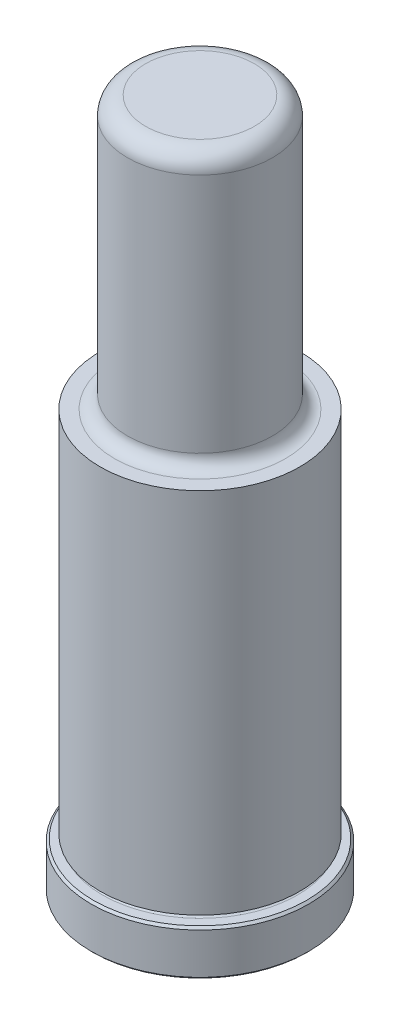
from build123d import *

# Parameters (mm, degrees)
CHAMFER1_SIZE = 0.381
FILLET7_R     = 3.175


with BuildPart() as part:
    # Sketch1 → Revolve1 (revolve)
    with BuildSketch(Plane(origin=(0, 0, 0), x_dir=(0, 0, -1), z_dir=(1, 0, 0)), mode=Mode.PRIVATE) as revolve1_sk:
        with BuildLine():
            Line((0, 0), (19.05, 0))
            Line((19.05, 0), (19.05, 7.9248))
            Line((19.05, 7.9248), (17.0688, 7.9248))
            ThreePointArc((17.0688, 7.9248), (16.6878, 8.3058), (17.0688, 8.6868))
            Line((17.0688, 8.6868), (17.4752, 8.6868))
            Line((17.4752, 8.6868), (17.4752, 73.025))
            Line((17.4752, 73.025), (14.9733, 73.025))
            ThreePointArc((14.9733, 73.025), (13.356853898, 73.694553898), (12.6873, 75.311))
            Line((12.6873, 75.311), (12.6873, 120.65))
            Line((12.6873, 120.65), (0, 120.65))
            Line((0, 120.65), (0, 0))
        make_face()
    revolve(revolve1_sk.sketch.rotate(Axis((0, 0, 0), (0, -1, 0)), 180), axis=Axis((0, 0, 0), (0, -1, 0)))

    # Chamfer1
    chamfer1_edges = [part.edges().sort_by_distance(p)[0] for p in [
        (0, 7.9248, -19.05),
        (0, 0, -19.05),
    ]]
    chamfer(chamfer1_edges, length=CHAMFER1_SIZE)

    # Fillet7
    fillet7_edges = [part.edges().sort_by_distance(p)[0] for p in [
        (0, 120.65, -12.6873),
    ]]
    fillet(fillet7_edges, radius=FILLET7_R)


solid = part.part
